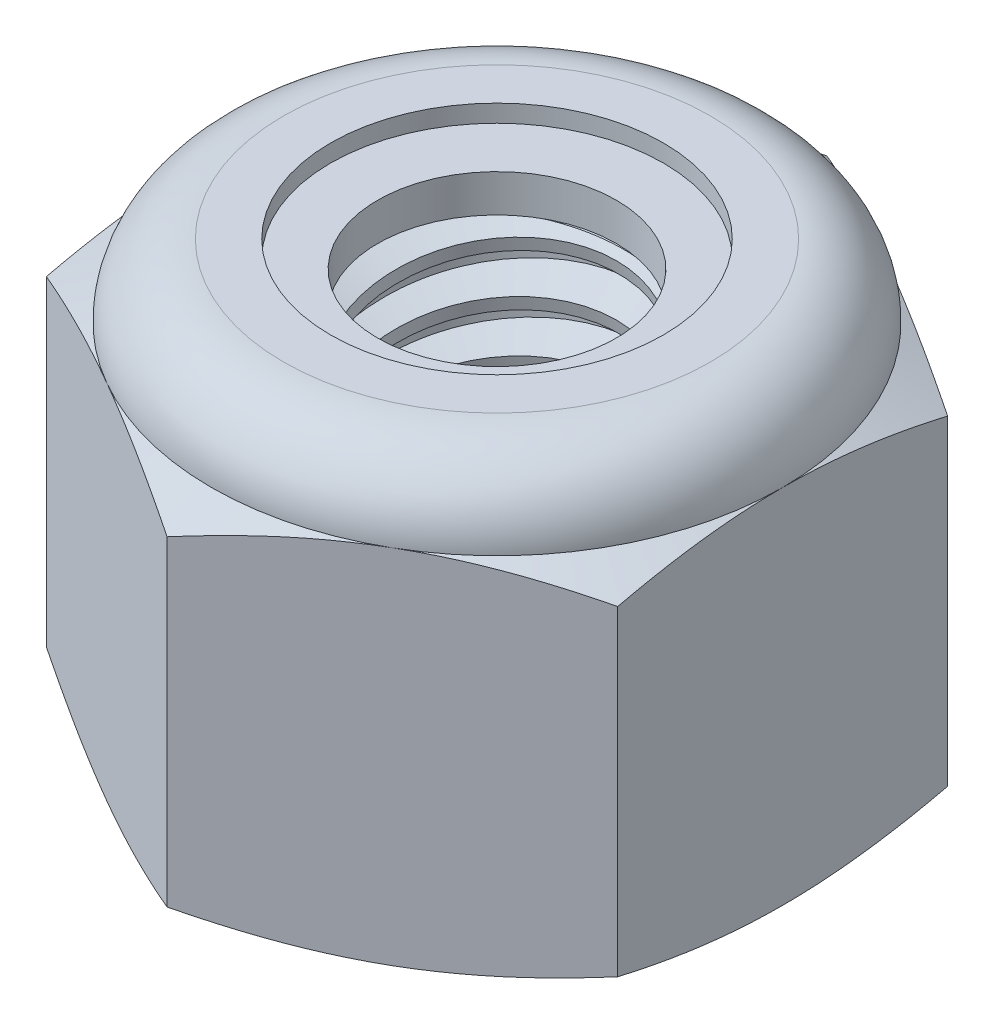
from build123d import *

# Parameters (mm, degrees)
EXTRUDE1_DEPTH      = 3.8
SKETCH2_W           = 1.25
SKETCH2_H           = 3.8
LPATTERN1_COUNT     = 8
LPATTERN1_PITCH     = 0.45
LPATTERN1_COL_COUNT = 2
LPATTERN1_COL_PITCH = 0.45


with BuildPart() as part:
    # Sketch1 → Extrude1 (new body)
    with BuildSketch(Plane(origin=(0, 0, 0), x_dir=(1, 0, 0), z_dir=(0, 1, 0))):
        Polygon((0, 2.886751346), (-2.5, 1.443375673), (-2.5, -1.443375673), (0, -2.886751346), (2.5, -1.443375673), (2.5, 1.443375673), align=None)
    extrude(amount=EXTRUDE1_DEPTH)

    # Sketch4 → Cut-Revolve2 (revolve, cut)
    with BuildSketch(Plane(origin=(0, 0, 0), x_dir=(0, 0, -1), z_dir=(1, 0, 0)), mode=Mode.PRIVATE) as cut_revolve2_sk:
        Polygon((0, 3.8), (1.25, 3.8), (1.045159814, 3.704481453), (1.045159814, 0.095518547), (1.25, 0), (0, 0), align=None)
    revolve(cut_revolve2_sk.sketch.rotate(Axis((0, 3.8, 0), (0, 1, 0)), 54.614775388), axis=Axis((0, 3.8, 0), (0, 1, 0)), mode=Mode.SUBTRACT)


with BuildPart() as body_2:
    # Sketch2 → Revolve1 (revolve)
    with BuildSketch(Plane(origin=(0, 0, 0), x_dir=(0, 0, -1), z_dir=(1, 0, 0))):
        with Locations((0.625, 1.9)):
            Rectangle(SKETCH2_W, SKETCH2_H)
    revolve(axis=Axis((0, -1.25, 0), (0, 1, 0)))

    # Sketch3 → Cut-Revolve1 (revolve, cut)
    with BuildSketch(Plane(origin=(0, 0, 0), x_dir=(0, 0, -1), z_dir=(1, 0, 0)), mode=Mode.PRIVATE) as cut_revolve1_sk:
        Polygon((1.259964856, 3.744639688), (1.329718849, 3.357117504), (1.065089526, 3.452369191), (1.045159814, 3.563089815), align=None)
    cut_revolve1 = revolve(cut_revolve1_sk.sketch.rotate(Axis((0, 3.8, 0.086794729), (0, -0.9841833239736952, -0.1771529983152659)), 180), axis=Axis((0, 3.8, 0.086794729), (0, -0.9841833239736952, -0.1771529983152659)), mode=Mode.SUBTRACT)

    # LPattern1: Cut-Revolve1 ×8
    with Locations(*[(0, -i * LPATTERN1_PITCH, 0) for i in range(1, LPATTERN1_COUNT)]):
        add(cut_revolve1, mode=Mode.SUBTRACT)

    # LPattern1 col: Cut-Revolve1 ×2
    with Locations(*[(0, i * LPATTERN1_COL_PITCH, 0) for i in range(1, LPATTERN1_COL_COUNT)]):
        add(cut_revolve1, mode=Mode.SUBTRACT)


with BuildPart() as part_1:
    add(part.part)

    # Combine1: cut body 2
    add(body_2.part, mode=Mode.SUBTRACT)

    # Sketch5 → Cut-Revolve3 (revolve, cut)
    with BuildSketch(Plane(origin=(0, 0, 0), x_dir=(0, 0, -1), z_dir=(1, 0, 0)), mode=Mode.PRIVATE) as cut_revolve3_sk:
        with BuildLine():
            Line((0, 0), (2.5, 0))
            Line((2.5, 0), (2.886751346, 0.180345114))
            Line((2.886751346, 0.180345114), (2.886751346, 2.986321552))
            Line((2.886751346, 2.986321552), (2.5, 3.166666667))
            ThreePointArc((2.5, 3.166666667), (2.314500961, 3.614500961), (1.866666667, 3.8))
            Line((1.866666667, 3.8), (1.866666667, 5.07))
            Line((1.866666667, 5.07), (4.156751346, 5.07))
            Line((4.156751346, 5.07), (4.156751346, -1.27))
            Line((4.156751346, -1.27), (0, -1.27))
            Line((0, -1.27), (0, 0))
        make_face()
    revolve(cut_revolve3_sk.sketch.rotate(Axis((0, 0, 0), (0, 1, 0)), 54.614775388), axis=Axis((0, 0, 0), (0, 1, 0)), mode=Mode.SUBTRACT)

    # Sketch6 → Cut-Revolve4 (revolve, cut)
    with BuildSketch(Plane(origin=(0, 0, 0), x_dir=(0, 0, -1), z_dir=(1, 0, 0)), mode=Mode.PRIVATE) as cut_revolve4_sk:
        with BuildLine():
            Line((0, 3.166666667), (2.3476, 3.166666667))
            ThreePointArc((2.3476, 3.166666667), (2.206737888, 3.506737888), (1.866666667, 3.6476))
            Line((1.866666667, 3.6476), (1.45591324, 3.6476))
            Line((1.45591324, 3.6476), (1.45591324, 5.07))
            Line((1.45591324, 5.07), (0, 5.07))
            Line((0, 5.07), (0, 3.166666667))
        make_face()
    revolve(cut_revolve4_sk.sketch.rotate(Axis((0, 5.07, 0), (0, 1, 0)), 54.614775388), axis=Axis((0, 5.07, 0), (0, 1, 0)), mode=Mode.SUBTRACT)


with BuildPart() as body_2_2:
    # Sketch7 → Revolve2 (revolve)
    with BuildSketch(Plane(origin=(0, 0, 0), x_dir=(0, 0, -1), z_dir=(1, 0, 0)), mode=Mode.PRIVATE) as revolve2_sk:
        with BuildLine():
            Line((1.045159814, 3.242866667), (2.264162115, 3.242866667))
            ThreePointArc((2.264162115, 3.242866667), (2.124511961, 3.478636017), (1.866666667, 3.5714))
            Line((1.866666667, 3.5714), (1.045159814, 3.5714))
            Line((1.045159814, 3.5714), (1.045159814, 3.242866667))
        make_face()
    revolve(revolve2_sk.sketch.rotate(Axis((0, 3.242866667, 0), (0, 1, 0)), 54.614775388), axis=Axis((0, 3.242866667, 0), (0, 1, 0)))


solid = Compound([part_1.part, body_2_2.part])
